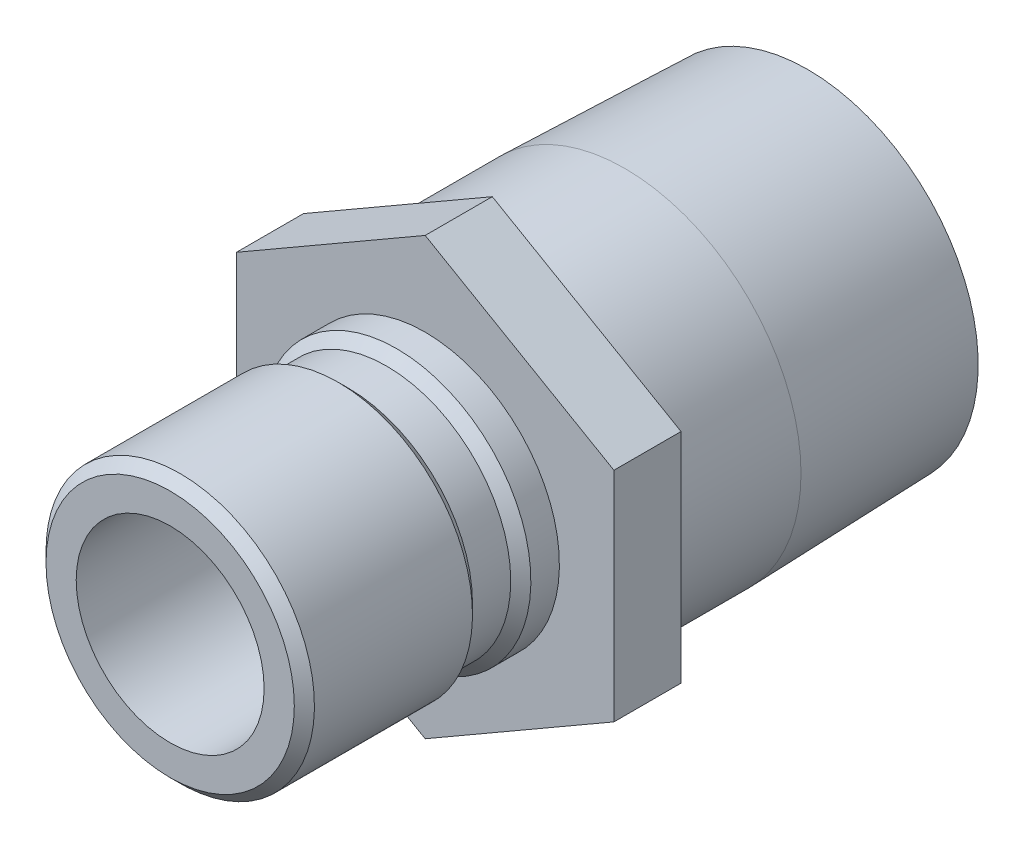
ISO-10303-21;
HEADER;
FILE_DESCRIPTION(('STEP AP214'),'2;1');
FILE_NAME('part.step','',(''),(''),'','','');
FILE_SCHEMA(('AUTOMOTIVE_DESIGN { 1 0 10303 214 1 1 1 1 }'));
ENDSEC;
DATA;
#1=APPLICATION_CONTEXT('core data for automotive mechanical design processes');
#2=APPLICATION_PROTOCOL_DEFINITION('international standard','automotive_design',2000,#1);
#3=PRODUCT_CONTEXT('',#1,'mechanical');
#4=PRODUCT('Part','Part','',(#3));
#5=PRODUCT_RELATED_PRODUCT_CATEGORY('part','',(#4));
#6=PRODUCT_DEFINITION_FORMATION('','',#4);
#7=PRODUCT_DEFINITION_CONTEXT('part definition',#1,'design');
#8=PRODUCT_DEFINITION('design','',#6,#7);
#9=PRODUCT_DEFINITION_SHAPE('','',#8);
#10=(LENGTH_UNIT() NAMED_UNIT(*) SI_UNIT(.MILLI.,.METRE.));
#11=(NAMED_UNIT(*) PLANE_ANGLE_UNIT() SI_UNIT($,.RADIAN.));
#12=(NAMED_UNIT(*) SI_UNIT($,.STERADIAN.) SOLID_ANGLE_UNIT());
#13=UNCERTAINTY_MEASURE_WITH_UNIT(LENGTH_MEASURE(1.E-05),#10,'distance_accuracy_value','');
#14=(GEOMETRIC_REPRESENTATION_CONTEXT(3) GLOBAL_UNCERTAINTY_ASSIGNED_CONTEXT((#13)) GLOBAL_UNIT_ASSIGNED_CONTEXT((#10,
#11,#12)) REPRESENTATION_CONTEXT('',''));
#15=CARTESIAN_POINT('',(0.,0.,0.));
#16=DIRECTION('',(0.,0.,1.));
#17=DIRECTION('',(1.,0.,0.));
#18=AXIS2_PLACEMENT_3D('',#15,#16,#17);
#19=CARTESIAN_POINT('',(0.,0.,0.));
#20=DIRECTION('',(0.,0.,-1.));
#21=DIRECTION('',(0.,1.,0.));
#22=AXIS2_PLACEMENT_3D('',#19,#20,#21);
#23=CYLINDRICAL_SURFACE('',#22,13.335);
#24=CARTESIAN_POINT('',(0.,0.,-15.113));
#25=DIRECTION('',(0.,0.,-1.));
#26=DIRECTION('',(0.,1.,0.));
#27=AXIS2_PLACEMENT_3D('',#24,#25,#26);
#28=CIRCLE('',#27,13.335);
#29=CARTESIAN_POINT('',(0.,13.335,-15.113));
#30=VERTEX_POINT('',#29);
#31=EDGE_CURVE('E42',#30,#30,#28,.T.);
#32=ORIENTED_EDGE('',*,*,#31,.F.);
#33=EDGE_LOOP('',(#32));
#34=FACE_BOUND('',#33,.T.);
#35=CARTESIAN_POINT('',(0.,0.,-5.08));
#36=DIRECTION('',(0.,0.,1.));
#37=DIRECTION('',(1.,0.,0.));
#38=AXIS2_PLACEMENT_3D('',#35,#36,#37);
#39=CIRCLE('',#38,13.335);
#40=CARTESIAN_POINT('',(13.335,0.,-5.08));
#41=VERTEX_POINT('',#40);
#42=EDGE_CURVE('E138',#41,#41,#39,.F.);
#43=ORIENTED_EDGE('',*,*,#42,.T.);
#44=EDGE_LOOP('',(#43));
#45=FACE_BOUND('',#44,.T.);
#46=ADVANCED_FACE('F33',(#34,#45),#23,.T.);
#47=CARTESIAN_POINT('',(0.,12.9024088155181,-28.956));
#48=DIRECTION('',(0.,0.,-1.));
#49=DIRECTION('',(0.,1.,0.));
#50=AXIS2_PLACEMENT_3D('',#47,#48,#49);
#51=PLANE('',#50);
#52=CARTESIAN_POINT('',(0.,0.,-28.956));
#53=DIRECTION('',(0.,0.,-1.));
#54=DIRECTION('',(0.,1.,0.));
#55=AXIS2_PLACEMENT_3D('',#52,#53,#54);
#56=CIRCLE('',#55,12.9024088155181);
#57=CARTESIAN_POINT('',(0.,12.9024088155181,-28.956));
#58=VERTEX_POINT('',#57);
#59=EDGE_CURVE('E12',#58,#58,#56,.T.);
#60=ORIENTED_EDGE('',*,*,#59,.T.);
#61=EDGE_LOOP('',(#60));
#62=FACE_BOUND('',#61,.T.);
#63=CARTESIAN_POINT('',(0.,0.,-28.956));
#64=DIRECTION('',(0.,0.,-1.));
#65=DIRECTION('',(0.,1.,0.));
#66=AXIS2_PLACEMENT_3D('',#63,#64,#65);
#67=CIRCLE('',#66,10.4648);
#68=CARTESIAN_POINT('',(0.,10.4648,-28.956));
#69=VERTEX_POINT('',#68);
#70=EDGE_CURVE('E146',#69,#69,#67,.T.);
#71=ORIENTED_EDGE('',*,*,#70,.F.);
#72=EDGE_LOOP('',(#71));
#73=FACE_BOUND('',#72,.T.);
#74=ADVANCED_FACE('F35',(#62,#73),#51,.T.);
#75=CARTESIAN_POINT('',(0.,0.,-28.956));
#76=DIRECTION('',(0.,0.,1.));
#77=DIRECTION('',(0.,-1.,0.));
#78=AXIS2_PLACEMENT_3D('',#75,#76,#77);
#79=CONICAL_SURFACE('',#78,12.9024088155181,0.0312396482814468);
#80=ORIENTED_EDGE('',*,*,#31,.T.);
#81=EDGE_LOOP('',(#80));
#82=FACE_BOUND('',#81,.T.);
#83=ORIENTED_EDGE('',*,*,#59,.F.);
#84=EDGE_LOOP('',(#83));
#85=FACE_BOUND('',#84,.T.);
#86=ADVANCED_FACE('F181',(#82,#85),#79,.T.);
#87=CARTESIAN_POINT('',(0.,10.16,0.));
#88=DIRECTION('',(0.,0.,1.));
#89=DIRECTION('',(0.,-1.,0.));
#90=AXIS2_PLACEMENT_3D('',#87,#88,#89);
#91=PLANE('',#90);
#92=CARTESIAN_POINT('',(0.,0.,0.));
#93=DIRECTION('',(0.,0.,-1.));
#94=DIRECTION('',(0.,1.,0.));
#95=AXIS2_PLACEMENT_3D('',#92,#93,#94);
#96=CIRCLE('',#95,10.16);
#97=CARTESIAN_POINT('',(0.,10.16,0.));
#98=VERTEX_POINT('',#97);
#99=EDGE_CURVE('E176',#98,#98,#96,.T.);
#100=ORIENTED_EDGE('',*,*,#99,.T.);
#101=EDGE_LOOP('',(#100));
#102=FACE_BOUND('',#101,.T.);
#103=DIRECTION('',(-0.866025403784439,-0.5,0.));
#104=VECTOR('',#103,1.);
#105=CARTESIAN_POINT('',(0.,16.4977839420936,0.));
#106=LINE('',#105,#104);
#107=CARTESIAN_POINT('',(0.,16.4977839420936,0.));
#108=VERTEX_POINT('',#107);
#109=CARTESIAN_POINT('',(-14.2875,8.24889197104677,0.));
#110=VERTEX_POINT('',#109);
#111=EDGE_CURVE('E121',#108,#110,#106,.T.);
#112=ORIENTED_EDGE('',*,*,#111,.T.);
#113=DIRECTION('',(0.,-1.,0.));
#114=VECTOR('',#113,1.);
#115=CARTESIAN_POINT('',(-14.2875,8.24889197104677,0.));
#116=LINE('',#115,#114);
#117=CARTESIAN_POINT('',(-14.2875,-8.24889197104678,0.));
#118=VERTEX_POINT('',#117);
#119=EDGE_CURVE('E124',#110,#118,#116,.T.);
#120=ORIENTED_EDGE('',*,*,#119,.T.);
#121=DIRECTION('',(0.866025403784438,-0.5,0.));
#122=VECTOR('',#121,1.);
#123=CARTESIAN_POINT('',(-14.2875,-8.24889197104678,0.));
#124=LINE('',#123,#122);
#125=CARTESIAN_POINT('',(0.,-16.4977839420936,0.));
#126=VERTEX_POINT('',#125);
#127=EDGE_CURVE('E127',#118,#126,#124,.T.);
#128=ORIENTED_EDGE('',*,*,#127,.T.);
#129=DIRECTION('',(0.866025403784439,0.5,0.));
#130=VECTOR('',#129,1.);
#131=CARTESIAN_POINT('',(0.,-16.4977839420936,0.));
#132=LINE('',#131,#130);
#133=CARTESIAN_POINT('',(14.2875,-8.24889197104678,0.));
#134=VERTEX_POINT('',#133);
#135=EDGE_CURVE('E130',#126,#134,#132,.T.);
#136=ORIENTED_EDGE('',*,*,#135,.T.);
#137=DIRECTION('',(0.,1.,0.));
#138=VECTOR('',#137,1.);
#139=CARTESIAN_POINT('',(14.2875,-8.24889197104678,0.));
#140=LINE('',#139,#138);
#141=CARTESIAN_POINT('',(14.2875,8.24889197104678,0.));
#142=VERTEX_POINT('',#141);
#143=EDGE_CURVE('E98',#134,#142,#140,.T.);
#144=ORIENTED_EDGE('',*,*,#143,.T.);
#145=DIRECTION('',(-0.866025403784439,0.5,0.));
#146=VECTOR('',#145,1.);
#147=CARTESIAN_POINT('',(14.2875,8.24889197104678,0.));
#148=LINE('',#147,#146);
#149=EDGE_CURVE('E133',#142,#108,#148,.T.);
#150=ORIENTED_EDGE('',*,*,#149,.T.);
#151=EDGE_LOOP('',(#112,#120,#128,#136,#144,#150));
#152=FACE_BOUND('',#151,.T.);
#153=ADVANCED_FACE('F250',(#102,#152),#91,.T.);
#154=CARTESIAN_POINT('',(0.,0.,0.));
#155=DIRECTION('',(0.,0.,-1.));
#156=DIRECTION('',(0.,1.,0.));
#157=AXIS2_PLACEMENT_3D('',#154,#155,#156);
#158=CYLINDRICAL_SURFACE('',#157,10.16);
#159=CARTESIAN_POINT('',(0.,0.,2.159));
#160=DIRECTION('',(0.,0.,-1.));
#161=DIRECTION('',(0.,1.,0.));
#162=AXIS2_PLACEMENT_3D('',#159,#160,#161);
#163=CIRCLE('',#162,10.16);
#164=CARTESIAN_POINT('',(0.,10.16,2.159));
#165=VERTEX_POINT('',#164);
#166=EDGE_CURVE('E173',#165,#165,#163,.T.);
#167=ORIENTED_EDGE('',*,*,#166,.T.);
#168=EDGE_LOOP('',(#167));
#169=FACE_BOUND('',#168,.T.);
#170=ORIENTED_EDGE('',*,*,#99,.F.);
#171=EDGE_LOOP('',(#170));
#172=FACE_BOUND('',#171,.T.);
#173=ADVANCED_FACE('F246',(#169,#172),#158,.T.);
#174=CARTESIAN_POINT('',(0.,0.,2.159));
#175=DIRECTION('',(0.,0.,-1.));
#176=DIRECTION('',(0.,1.,0.));
#177=AXIS2_PLACEMENT_3D('',#174,#175,#176);
#178=CONICAL_SURFACE('',#177,10.16,0.785398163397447);
#179=CARTESIAN_POINT('',(0.,0.,2.921));
#180=DIRECTION('',(0.,0.,-1.));
#181=DIRECTION('',(0.,1.,0.));
#182=AXIS2_PLACEMENT_3D('',#179,#180,#181);
#183=CIRCLE('',#182,9.398);
#184=CARTESIAN_POINT('',(0.,9.398,2.921));
#185=VERTEX_POINT('',#184);
#186=EDGE_CURVE('E170',#185,#185,#183,.T.);
#187=ORIENTED_EDGE('',*,*,#186,.T.);
#188=EDGE_LOOP('',(#187));
#189=FACE_BOUND('',#188,.T.);
#190=ORIENTED_EDGE('',*,*,#166,.F.);
#191=EDGE_LOOP('',(#190));
#192=FACE_BOUND('',#191,.T.);
#193=ADVANCED_FACE('F242',(#189,#192),#178,.T.);
#194=CARTESIAN_POINT('',(0.,0.,0.));
#195=DIRECTION('',(0.,0.,-1.));
#196=DIRECTION('',(0.,1.,0.));
#197=AXIS2_PLACEMENT_3D('',#194,#195,#196);
#198=CYLINDRICAL_SURFACE('',#197,9.398);
#199=CARTESIAN_POINT('',(0.,0.,5.8166));
#200=DIRECTION('',(0.,0.,-1.));
#201=DIRECTION('',(0.,1.,0.));
#202=AXIS2_PLACEMENT_3D('',#199,#200,#201);
#203=CIRCLE('',#202,9.398);
#204=CARTESIAN_POINT('',(0.,9.398,5.8166));
#205=VERTEX_POINT('',#204);
#206=EDGE_CURVE('E167',#205,#205,#203,.T.);
#207=ORIENTED_EDGE('',*,*,#206,.T.);
#208=EDGE_LOOP('',(#207));
#209=FACE_BOUND('',#208,.T.);
#210=ORIENTED_EDGE('',*,*,#186,.F.);
#211=EDGE_LOOP('',(#210));
#212=FACE_BOUND('',#211,.T.);
#213=ADVANCED_FACE('F238',(#209,#212),#198,.T.);
#214=CARTESIAN_POINT('',(0.,0.,5.8166));
#215=DIRECTION('',(0.,0.,1.));
#216=DIRECTION('',(0.,-1.,0.));
#217=AXIS2_PLACEMENT_3D('',#214,#215,#216);
#218=CONICAL_SURFACE('',#217,9.398,0.785398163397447);
#219=CARTESIAN_POINT('',(0.,0.,6.5786));
#220=DIRECTION('',(0.,0.,-1.));
#221=DIRECTION('',(0.,1.,0.));
#222=AXIS2_PLACEMENT_3D('',#219,#220,#221);
#223=CIRCLE('',#222,10.16);
#224=CARTESIAN_POINT('',(0.,10.16,6.5786));
#225=VERTEX_POINT('',#224);
#226=EDGE_CURVE('E164',#225,#225,#223,.T.);
#227=ORIENTED_EDGE('',*,*,#226,.T.);
#228=EDGE_LOOP('',(#227));
#229=FACE_BOUND('',#228,.T.);
#230=ORIENTED_EDGE('',*,*,#206,.F.);
#231=EDGE_LOOP('',(#230));
#232=FACE_BOUND('',#231,.T.);
#233=ADVANCED_FACE('F234',(#229,#232),#218,.T.);
#234=CARTESIAN_POINT('',(0.,0.,0.));
#235=DIRECTION('',(0.,0.,-1.));
#236=DIRECTION('',(0.,1.,0.));
#237=AXIS2_PLACEMENT_3D('',#234,#235,#236);
#238=CYLINDRICAL_SURFACE('',#237,10.16);
#239=CARTESIAN_POINT('',(0.,0.,18.542));
#240=DIRECTION('',(0.,0.,-1.));
#241=DIRECTION('',(0.,1.,0.));
#242=AXIS2_PLACEMENT_3D('',#239,#240,#241);
#243=CIRCLE('',#242,10.16);
#244=CARTESIAN_POINT('',(0.,10.16,18.542));
#245=VERTEX_POINT('',#244);
#246=EDGE_CURVE('E161',#245,#245,#243,.T.);
#247=ORIENTED_EDGE('',*,*,#246,.T.);
#248=EDGE_LOOP('',(#247));
#249=FACE_BOUND('',#248,.T.);
#250=ORIENTED_EDGE('',*,*,#226,.F.);
#251=EDGE_LOOP('',(#250));
#252=FACE_BOUND('',#251,.T.);
#253=ADVANCED_FACE('F230',(#249,#252),#238,.T.);
#254=CARTESIAN_POINT('',(0.,0.,18.542));
#255=DIRECTION('',(0.,0.,-1.));
#256=DIRECTION('',(0.,1.,0.));
#257=AXIS2_PLACEMENT_3D('',#254,#255,#256);
#258=CONICAL_SURFACE('',#257,10.16,0.785398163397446);
#259=CARTESIAN_POINT('',(0.,0.,19.304));
#260=DIRECTION('',(0.,0.,-1.));
#261=DIRECTION('',(0.,1.,0.));
#262=AXIS2_PLACEMENT_3D('',#259,#260,#261);
#263=CIRCLE('',#262,9.398);
#264=CARTESIAN_POINT('',(0.,9.398,19.304));
#265=VERTEX_POINT('',#264);
#266=EDGE_CURVE('E158',#265,#265,#263,.T.);
#267=ORIENTED_EDGE('',*,*,#266,.T.);
#268=EDGE_LOOP('',(#267));
#269=FACE_BOUND('',#268,.T.);
#270=ORIENTED_EDGE('',*,*,#246,.F.);
#271=EDGE_LOOP('',(#270));
#272=FACE_BOUND('',#271,.T.);
#273=ADVANCED_FACE('F226',(#269,#272),#258,.T.);
#274=CARTESIAN_POINT('',(0.,7.112,19.304));
#275=DIRECTION('',(0.,0.,1.));
#276=DIRECTION('',(0.,-1.,0.));
#277=AXIS2_PLACEMENT_3D('',#274,#275,#276);
#278=PLANE('',#277);
#279=CARTESIAN_POINT('',(0.,0.,19.304));
#280=DIRECTION('',(0.,0.,-1.));
#281=DIRECTION('',(0.,1.,0.));
#282=AXIS2_PLACEMENT_3D('',#279,#280,#281);
#283=CIRCLE('',#282,7.112);
#284=CARTESIAN_POINT('',(0.,7.112,19.304));
#285=VERTEX_POINT('',#284);
#286=EDGE_CURVE('E155',#285,#285,#283,.T.);
#287=ORIENTED_EDGE('',*,*,#286,.T.);
#288=EDGE_LOOP('',(#287));
#289=FACE_BOUND('',#288,.T.);
#290=ORIENTED_EDGE('',*,*,#266,.F.);
#291=EDGE_LOOP('',(#290));
#292=FACE_BOUND('',#291,.T.);
#293=ADVANCED_FACE('F222',(#289,#292),#278,.T.);
#294=CARTESIAN_POINT('',(0.,0.,0.));
#295=DIRECTION('',(0.,0.,-1.));
#296=DIRECTION('',(0.,1.,0.));
#297=AXIS2_PLACEMENT_3D('',#294,#295,#296);
#298=CYLINDRICAL_SURFACE('',#297,7.112);
#299=CARTESIAN_POINT('',(0.,0.,-1.27));
#300=DIRECTION('',(0.,0.,-1.));
#301=DIRECTION('',(0.,1.,0.));
#302=AXIS2_PLACEMENT_3D('',#299,#300,#301);
#303=CIRCLE('',#302,7.112);
#304=CARTESIAN_POINT('',(0.,7.112,-1.27));
#305=VERTEX_POINT('',#304);
#306=EDGE_CURVE('E152',#305,#305,#303,.T.);
#307=ORIENTED_EDGE('',*,*,#306,.T.);
#308=EDGE_LOOP('',(#307));
#309=FACE_BOUND('',#308,.T.);
#310=ORIENTED_EDGE('',*,*,#286,.F.);
#311=EDGE_LOOP('',(#310));
#312=FACE_BOUND('',#311,.T.);
#313=ADVANCED_FACE('F218',(#309,#312),#298,.F.);
#314=CARTESIAN_POINT('',(0.,0.,-1.27));
#315=DIRECTION('',(0.,0.,-1.));
#316=DIRECTION('',(0.,1.,0.));
#317=AXIS2_PLACEMENT_3D('',#314,#315,#316);
#318=CONICAL_SURFACE('',#317,7.112,1.08210413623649);
#319=CARTESIAN_POINT('',(0.,0.,-3.0527153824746));
#320=DIRECTION('',(0.,0.,-1.));
#321=DIRECTION('',(0.,1.,0.));
#322=AXIS2_PLACEMENT_3D('',#319,#320,#321);
#323=CIRCLE('',#322,10.4648);
#324=CARTESIAN_POINT('',(0.,10.4648,-3.0527153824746));
#325=VERTEX_POINT('',#324);
#326=EDGE_CURVE('E149',#325,#325,#323,.T.);
#327=ORIENTED_EDGE('',*,*,#326,.T.);
#328=EDGE_LOOP('',(#327));
#329=FACE_BOUND('',#328,.T.);
#330=ORIENTED_EDGE('',*,*,#306,.F.);
#331=EDGE_LOOP('',(#330));
#332=FACE_BOUND('',#331,.T.);
#333=ADVANCED_FACE('F214',(#329,#332),#318,.F.);
#334=CARTESIAN_POINT('',(0.,0.,0.));
#335=DIRECTION('',(0.,0.,-1.));
#336=DIRECTION('',(0.,1.,0.));
#337=AXIS2_PLACEMENT_3D('',#334,#335,#336);
#338=CYLINDRICAL_SURFACE('',#337,10.4648);
#339=ORIENTED_EDGE('',*,*,#326,.F.);
#340=EDGE_LOOP('',(#339));
#341=FACE_BOUND('',#340,.T.);
#342=ORIENTED_EDGE('',*,*,#70,.T.);
#343=EDGE_LOOP('',(#342));
#344=FACE_BOUND('',#343,.T.);
#345=ADVANCED_FACE('F211',(#341,#344),#338,.F.);
#346=CARTESIAN_POINT('',(0.,16.4977839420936,-5.08));
#347=DIRECTION('',(-0.5,0.866025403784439,0.));
#348=DIRECTION('',(-0.866025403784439,-0.5,0.));
#349=AXIS2_PLACEMENT_3D('',#346,#347,#348);
#350=PLANE('',#349);
#351=ORIENTED_EDGE('',*,*,#111,.F.);
#352=DIRECTION('',(0.,0.,1.));
#353=VECTOR('',#352,1.);
#354=CARTESIAN_POINT('',(0.,16.4977839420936,-5.08));
#355=LINE('',#354,#353);
#356=CARTESIAN_POINT('',(0.,16.4977839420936,-5.08));
#357=VERTEX_POINT('',#356);
#358=EDGE_CURVE('E50',#357,#108,#355,.T.);
#359=ORIENTED_EDGE('',*,*,#358,.F.);
#360=DIRECTION('',(-0.866025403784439,-0.5,0.));
#361=VECTOR('',#360,1.);
#362=CARTESIAN_POINT('',(0.,16.4977839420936,-5.08));
#363=LINE('',#362,#361);
#364=CARTESIAN_POINT('',(-14.2875,8.24889197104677,-5.08));
#365=VERTEX_POINT('',#364);
#366=EDGE_CURVE('E136',#357,#365,#363,.T.);
#367=ORIENTED_EDGE('',*,*,#366,.T.);
#368=DIRECTION('',(0.,0.,1.));
#369=VECTOR('',#368,1.);
#370=CARTESIAN_POINT('',(-14.2875,8.24889197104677,-5.08));
#371=LINE('',#370,#369);
#372=EDGE_CURVE('E85',#365,#110,#371,.T.);
#373=ORIENTED_EDGE('',*,*,#372,.T.);
#374=EDGE_LOOP('',(#351,#359,#367,#373));
#375=FACE_BOUND('',#374,.T.);
#376=ADVANCED_FACE('F201',(#375),#350,.T.);
#377=CARTESIAN_POINT('',(14.2875,8.24889197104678,-5.08));
#378=DIRECTION('',(0.5,0.866025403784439,0.));
#379=DIRECTION('',(-0.866025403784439,0.5,0.));
#380=AXIS2_PLACEMENT_3D('',#377,#378,#379);
#381=PLANE('',#380);
#382=ORIENTED_EDGE('',*,*,#149,.F.);
#383=DIRECTION('',(0.,0.,1.));
#384=VECTOR('',#383,1.);
#385=CARTESIAN_POINT('',(14.2875,8.24889197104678,-5.08));
#386=LINE('',#385,#384);
#387=CARTESIAN_POINT('',(14.2875,8.24889197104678,-5.08));
#388=VERTEX_POINT('',#387);
#389=EDGE_CURVE('E73',#388,#142,#386,.T.);
#390=ORIENTED_EDGE('',*,*,#389,.F.);
#391=DIRECTION('',(-0.866025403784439,0.5,0.));
#392=VECTOR('',#391,1.);
#393=CARTESIAN_POINT('',(14.2875,8.24889197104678,-5.08));
#394=LINE('',#393,#392);
#395=EDGE_CURVE('E111',#388,#357,#394,.T.);
#396=ORIENTED_EDGE('',*,*,#395,.T.);
#397=ORIENTED_EDGE('',*,*,#358,.T.);
#398=EDGE_LOOP('',(#382,#390,#396,#397));
#399=FACE_BOUND('',#398,.T.);
#400=ADVANCED_FACE('F198',(#399),#381,.T.);
#401=CARTESIAN_POINT('',(14.2875,-8.24889197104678,-5.08));
#402=DIRECTION('',(1.,0.,0.));
#403=DIRECTION('',(0.,1.,0.));
#404=AXIS2_PLACEMENT_3D('',#401,#402,#403);
#405=PLANE('',#404);
#406=ORIENTED_EDGE('',*,*,#143,.F.);
#407=DIRECTION('',(0.,0.,1.));
#408=VECTOR('',#407,1.);
#409=CARTESIAN_POINT('',(14.2875,-8.24889197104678,-5.08));
#410=LINE('',#409,#408);
#411=CARTESIAN_POINT('',(14.2875,-8.24889197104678,-5.08));
#412=VERTEX_POINT('',#411);
#413=EDGE_CURVE('E93',#412,#134,#410,.T.);
#414=ORIENTED_EDGE('',*,*,#413,.F.);
#415=DIRECTION('',(0.,1.,0.));
#416=VECTOR('',#415,1.);
#417=CARTESIAN_POINT('',(14.2875,-8.24889197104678,-5.08));
#418=LINE('',#417,#416);
#419=EDGE_CURVE('E96',#412,#388,#418,.T.);
#420=ORIENTED_EDGE('',*,*,#419,.T.);
#421=ORIENTED_EDGE('',*,*,#389,.T.);
#422=EDGE_LOOP('',(#406,#414,#420,#421));
#423=FACE_BOUND('',#422,.T.);
#424=ADVANCED_FACE('F95',(#423),#405,.T.);
#425=CARTESIAN_POINT('',(0.,-16.4977839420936,-5.08));
#426=DIRECTION('',(0.5,-0.866025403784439,0.));
#427=DIRECTION('',(0.866025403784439,0.5,0.));
#428=AXIS2_PLACEMENT_3D('',#425,#426,#427);
#429=PLANE('',#428);
#430=ORIENTED_EDGE('',*,*,#135,.F.);
#431=DIRECTION('',(0.,0.,1.));
#432=VECTOR('',#431,1.);
#433=CARTESIAN_POINT('',(0.,-16.4977839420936,-5.08));
#434=LINE('',#433,#432);
#435=CARTESIAN_POINT('',(0.,-16.4977839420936,-5.08));
#436=VERTEX_POINT('',#435);
#437=EDGE_CURVE('E103',#436,#126,#434,.T.);
#438=ORIENTED_EDGE('',*,*,#437,.F.);
#439=DIRECTION('',(0.866025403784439,0.5,0.));
#440=VECTOR('',#439,1.);
#441=CARTESIAN_POINT('',(0.,-16.4977839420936,-5.08));
#442=LINE('',#441,#440);
#443=EDGE_CURVE('E109',#436,#412,#442,.T.);
#444=ORIENTED_EDGE('',*,*,#443,.T.);
#445=ORIENTED_EDGE('',*,*,#413,.T.);
#446=EDGE_LOOP('',(#430,#438,#444,#445));
#447=FACE_BOUND('',#446,.T.);
#448=ADVANCED_FACE('F113',(#447),#429,.T.);
#449=CARTESIAN_POINT('',(-14.2875,-8.24889197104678,-5.08));
#450=DIRECTION('',(-0.5,-0.866025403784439,0.));
#451=DIRECTION('',(0.866025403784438,-0.5,0.));
#452=AXIS2_PLACEMENT_3D('',#449,#450,#451);
#453=PLANE('',#452);
#454=ORIENTED_EDGE('',*,*,#127,.F.);
#455=DIRECTION('',(0.,0.,1.));
#456=VECTOR('',#455,1.);
#457=CARTESIAN_POINT('',(-14.2875,-8.24889197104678,-5.08));
#458=LINE('',#457,#456);
#459=CARTESIAN_POINT('',(-14.2875,-8.24889197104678,-5.08));
#460=VERTEX_POINT('',#459);
#461=EDGE_CURVE('E141',#460,#118,#458,.T.);
#462=ORIENTED_EDGE('',*,*,#461,.F.);
#463=DIRECTION('',(0.866025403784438,-0.5,0.));
#464=VECTOR('',#463,1.);
#465=CARTESIAN_POINT('',(-14.2875,-8.24889197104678,-5.08));
#466=LINE('',#465,#464);
#467=EDGE_CURVE('E114',#460,#436,#466,.T.);
#468=ORIENTED_EDGE('',*,*,#467,.T.);
#469=ORIENTED_EDGE('',*,*,#437,.T.);
#470=EDGE_LOOP('',(#454,#462,#468,#469));
#471=FACE_BOUND('',#470,.T.);
#472=ADVANCED_FACE('F195',(#471),#453,.T.);
#473=CARTESIAN_POINT('',(-14.2875,8.24889197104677,-5.08));
#474=DIRECTION('',(-1.,0.,0.));
#475=DIRECTION('',(0.,0.,1.));
#476=AXIS2_PLACEMENT_3D('',#473,#474,#475);
#477=PLANE('',#476);
#478=ORIENTED_EDGE('',*,*,#119,.F.);
#479=ORIENTED_EDGE('',*,*,#372,.F.);
#480=DIRECTION('',(0.,-1.,0.));
#481=VECTOR('',#480,1.);
#482=CARTESIAN_POINT('',(-14.2875,8.24889197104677,-5.08));
#483=LINE('',#482,#481);
#484=EDGE_CURVE('E116',#365,#460,#483,.T.);
#485=ORIENTED_EDGE('',*,*,#484,.T.);
#486=ORIENTED_EDGE('',*,*,#461,.T.);
#487=EDGE_LOOP('',(#478,#479,#485,#486));
#488=FACE_BOUND('',#487,.T.);
#489=ADVANCED_FACE('F190',(#488),#477,.T.);
#490=CARTESIAN_POINT('',(-14.2875,8.24889197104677,-5.08));
#491=DIRECTION('',(0.,0.,1.));
#492=DIRECTION('',(1.,0.,0.));
#493=AXIS2_PLACEMENT_3D('',#490,#491,#492);
#494=PLANE('',#493);
#495=ORIENTED_EDGE('',*,*,#42,.F.);
#496=EDGE_LOOP('',(#495));
#497=FACE_BOUND('',#496,.T.);
#498=ORIENTED_EDGE('',*,*,#366,.F.);
#499=ORIENTED_EDGE('',*,*,#395,.F.);
#500=ORIENTED_EDGE('',*,*,#419,.F.);
#501=ORIENTED_EDGE('',*,*,#443,.F.);
#502=ORIENTED_EDGE('',*,*,#467,.F.);
#503=ORIENTED_EDGE('',*,*,#484,.F.);
#504=EDGE_LOOP('',(#498,#499,#500,#501,#502,#503));
#505=FACE_BOUND('',#504,.T.);
#506=ADVANCED_FACE('F107',(#497,#505),#494,.F.);
#507=CLOSED_SHELL('',(#46,#74,#86,#153,#173,#193,#213,#233,#253,#273,#293,#313,#333,#345,#376,
#400,#424,#448,#472,#489,#506));
#508=MANIFOLD_SOLID_BREP('B2',#507);
#509=ADVANCED_BREP_SHAPE_REPRESENTATION('',(#18,#508),#14);
#510=SHAPE_DEFINITION_REPRESENTATION(#9,#509);
ENDSEC;
END-ISO-10303-21;
